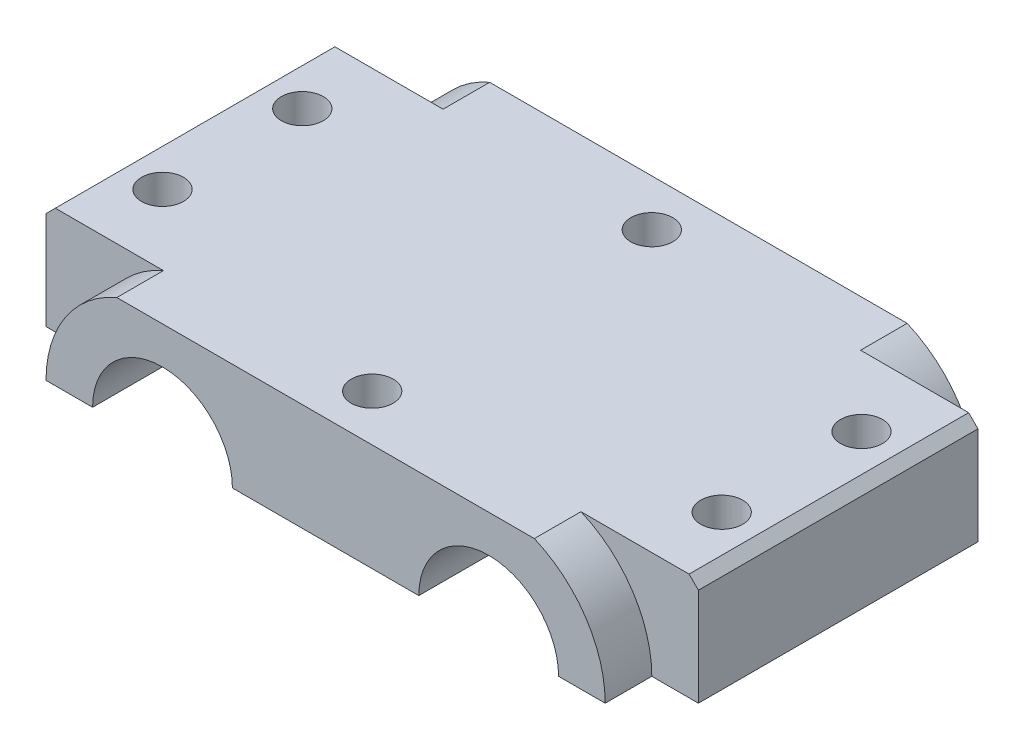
ISO-10303-21;
HEADER;
FILE_DESCRIPTION(('STEP AP214'),'2;1');
FILE_NAME('part.step','',(''),(''),'','','');
FILE_SCHEMA(('AUTOMOTIVE_DESIGN { 1 0 10303 214 1 1 1 1 }'));
ENDSEC;
DATA;
#1=APPLICATION_CONTEXT('core data for automotive mechanical design processes');
#2=APPLICATION_PROTOCOL_DEFINITION('international standard','automotive_design',2000,#1);
#3=PRODUCT_CONTEXT('',#1,'mechanical');
#4=PRODUCT('Part','Part','',(#3));
#5=PRODUCT_RELATED_PRODUCT_CATEGORY('part','',(#4));
#6=PRODUCT_DEFINITION_FORMATION('','',#4);
#7=PRODUCT_DEFINITION_CONTEXT('part definition',#1,'design');
#8=PRODUCT_DEFINITION('design','',#6,#7);
#9=PRODUCT_DEFINITION_SHAPE('','',#8);
#10=(LENGTH_UNIT() NAMED_UNIT(*) SI_UNIT(.MILLI.,.METRE.));
#11=(NAMED_UNIT(*) PLANE_ANGLE_UNIT() SI_UNIT($,.RADIAN.));
#12=(NAMED_UNIT(*) SI_UNIT($,.STERADIAN.) SOLID_ANGLE_UNIT());
#13=UNCERTAINTY_MEASURE_WITH_UNIT(LENGTH_MEASURE(1.E-05),#10,'distance_accuracy_value','');
#14=(GEOMETRIC_REPRESENTATION_CONTEXT(3) GLOBAL_UNCERTAINTY_ASSIGNED_CONTEXT((#13)) GLOBAL_UNIT_ASSIGNED_CONTEXT((#10,
#11,#12)) REPRESENTATION_CONTEXT('',''));
#15=CARTESIAN_POINT('',(0.,0.,0.));
#16=DIRECTION('',(0.,0.,1.));
#17=DIRECTION('',(1.,0.,0.));
#18=AXIS2_PLACEMENT_3D('',#15,#16,#17);
#19=CARTESIAN_POINT('',(-35.,11.5,-15.));
#20=DIRECTION('',(0.,0.,1.));
#21=DIRECTION('',(1.,0.,0.));
#22=AXIS2_PLACEMENT_3D('',#19,#20,#21);
#23=PLANE('',#22);
#24=DIRECTION('',(-1.,0.,0.));
#25=VECTOR('',#24,1.);
#26=CARTESIAN_POINT('',(-35.,11.5,-15.));
#27=LINE('',#26,#25);
#28=CARTESIAN_POINT('',(34.,11.5,-15.));
#29=VERTEX_POINT('',#28);
#30=CARTESIAN_POINT('',(22.3989794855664,11.5,-15.));
#31=VERTEX_POINT('',#30);
#32=EDGE_CURVE('E330',#29,#31,#27,.T.);
#33=ORIENTED_EDGE('',*,*,#32,.F.);
#34=DIRECTION('',(-0.707106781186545,0.70710678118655,0.));
#35=VECTOR('',#34,1.);
#36=CARTESIAN_POINT('',(34.,11.5,-15.));
#37=LINE('',#36,#35);
#38=CARTESIAN_POINT('',(35.,10.5,-15.));
#39=VERTEX_POINT('',#38);
#40=EDGE_CURVE('E65',#29,#39,#37,.F.);
#41=ORIENTED_EDGE('',*,*,#40,.T.);
#42=DIRECTION('',(0.,-1.,0.));
#43=VECTOR('',#42,1.);
#44=CARTESIAN_POINT('',(35.,11.5,-15.));
#45=LINE('',#44,#43);
#46=CARTESIAN_POINT('',(35.,0.,-15.));
#47=VERTEX_POINT('',#46);
#48=EDGE_CURVE('E363',#39,#47,#45,.T.);
#49=ORIENTED_EDGE('',*,*,#48,.T.);
#50=DIRECTION('',(-1.,0.,0.));
#51=VECTOR('',#50,1.);
#52=CARTESIAN_POINT('',(-35.,0.,-15.));
#53=LINE('',#52,#51);
#54=CARTESIAN_POINT('',(30.,0.,-15.));
#55=VERTEX_POINT('',#54);
#56=EDGE_CURVE('E343',#47,#55,#53,.T.);
#57=ORIENTED_EDGE('',*,*,#56,.T.);
#58=CARTESIAN_POINT('',(17.5,0.,-15.));
#59=DIRECTION('',(0.,0.,1.));
#60=DIRECTION('',(1.,0.,0.));
#61=AXIS2_PLACEMENT_3D('',#58,#59,#60);
#62=CIRCLE('',#61,12.5);
#63=EDGE_CURVE('E192',#55,#31,#62,.T.);
#64=ORIENTED_EDGE('',*,*,#63,.T.);
#65=EDGE_LOOP('',(#33,#41,#49,#57,#64));
#66=FACE_BOUND('',#65,.T.);
#67=ADVANCED_FACE('F41',(#66),#23,.F.);
#68=CARTESIAN_POINT('',(0.,0.,0.));
#69=DIRECTION('',(0.,-1.,0.));
#70=DIRECTION('',(0.,0.,-1.));
#71=AXIS2_PLACEMENT_3D('',#68,#69,#70);
#72=PLANE('',#71);
#73=CARTESIAN_POINT('',(0.,0.,-15.));
#74=DIRECTION('',(0.,1.,0.));
#75=DIRECTION('',(0.,0.,1.));
#76=AXIS2_PLACEMENT_3D('',#73,#74,#75);
#77=CIRCLE('',#76,2.25);
#78=CARTESIAN_POINT('',(0.,0.,-12.75));
#79=VERTEX_POINT('',#78);
#80=EDGE_CURVE('E228',#79,#79,#77,.T.);
#81=ORIENTED_EDGE('',*,*,#80,.T.);
#82=EDGE_LOOP('',(#81));
#83=FACE_BOUND('',#82,.T.);
#84=CARTESIAN_POINT('',(0.,0.,15.));
#85=DIRECTION('',(0.,1.,0.));
#86=DIRECTION('',(0.,0.,1.));
#87=AXIS2_PLACEMENT_3D('',#84,#85,#86);
#88=CIRCLE('',#87,2.25);
#89=CARTESIAN_POINT('',(0.,0.,17.25));
#90=VERTEX_POINT('',#89);
#91=EDGE_CURVE('E574',#90,#90,#88,.T.);
#92=ORIENTED_EDGE('',*,*,#91,.T.);
#93=EDGE_LOOP('',(#92));
#94=FACE_BOUND('',#93,.T.);
#95=DIRECTION('',(0.,0.,-1.));
#96=VECTOR('',#95,1.);
#97=CARTESIAN_POINT('',(-10.,0.,20.));
#98=LINE('',#97,#96);
#99=CARTESIAN_POINT('',(-10.,0.,20.));
#100=VERTEX_POINT('',#99);
#101=CARTESIAN_POINT('',(-10.,0.,-20.));
#102=VERTEX_POINT('',#101);
#103=EDGE_CURVE('E294',#100,#102,#98,.T.);
#104=ORIENTED_EDGE('',*,*,#103,.T.);
#105=DIRECTION('',(1.,0.,0.));
#106=VECTOR('',#105,1.);
#107=CARTESIAN_POINT('',(-10.,0.,-20.));
#108=LINE('',#107,#106);
#109=CARTESIAN_POINT('',(9.99999999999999,0.,-20.));
#110=VERTEX_POINT('',#109);
#111=EDGE_CURVE('E190',#102,#110,#108,.T.);
#112=ORIENTED_EDGE('',*,*,#111,.T.);
#113=DIRECTION('',(0.,0.,-1.));
#114=VECTOR('',#113,1.);
#115=CARTESIAN_POINT('',(9.99999999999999,0.,20.));
#116=LINE('',#115,#114);
#117=CARTESIAN_POINT('',(9.99999999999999,0.,20.));
#118=VERTEX_POINT('',#117);
#119=EDGE_CURVE('E291',#118,#110,#116,.T.);
#120=ORIENTED_EDGE('',*,*,#119,.F.);
#121=DIRECTION('',(1.,0.,0.));
#122=VECTOR('',#121,1.);
#123=CARTESIAN_POINT('',(-10.,0.,20.));
#124=LINE('',#123,#122);
#125=EDGE_CURVE('E246',#100,#118,#124,.T.);
#126=ORIENTED_EDGE('',*,*,#125,.F.);
#127=EDGE_LOOP('',(#104,#112,#120,#126));
#128=FACE_BOUND('',#127,.T.);
#129=ADVANCED_FACE('F431',(#83,#94,#128),#72,.T.);
#130=DIRECTION('',(0.,0.,-1.));
#131=VECTOR('',#130,1.);
#132=CARTESIAN_POINT('',(25.,0.,20.));
#133=LINE('',#132,#131);
#134=CARTESIAN_POINT('',(25.,0.,20.));
#135=VERTEX_POINT('',#134);
#136=CARTESIAN_POINT('',(25.,0.,-20.));
#137=VERTEX_POINT('',#136);
#138=EDGE_CURVE('E288',#135,#137,#133,.T.);
#139=ORIENTED_EDGE('',*,*,#138,.T.);
#140=DIRECTION('',(1.,0.,0.));
#141=VECTOR('',#140,1.);
#142=CARTESIAN_POINT('',(25.,0.,-20.));
#143=LINE('',#142,#141);
#144=CARTESIAN_POINT('',(30.,0.,-20.));
#145=VERTEX_POINT('',#144);
#146=EDGE_CURVE('E213',#137,#145,#143,.T.);
#147=ORIENTED_EDGE('',*,*,#146,.T.);
#148=DIRECTION('',(0.,0.,1.));
#149=VECTOR('',#148,1.);
#150=CARTESIAN_POINT('',(30.,0.,-20.));
#151=LINE('',#150,#149);
#152=EDGE_CURVE('E223',#145,#55,#151,.T.);
#153=ORIENTED_EDGE('',*,*,#152,.T.);
#154=ORIENTED_EDGE('',*,*,#56,.F.);
#155=DIRECTION('',(0.,0.,-1.));
#156=VECTOR('',#155,1.);
#157=CARTESIAN_POINT('',(35.,0.,15.));
#158=LINE('',#157,#156);
#159=CARTESIAN_POINT('',(35.,0.,15.));
#160=VERTEX_POINT('',#159);
#161=EDGE_CURVE('E326',#160,#47,#158,.T.);
#162=ORIENTED_EDGE('',*,*,#161,.F.);
#163=DIRECTION('',(1.,0.,0.));
#164=VECTOR('',#163,1.);
#165=CARTESIAN_POINT('',(-35.,0.,15.));
#166=LINE('',#165,#164);
#167=CARTESIAN_POINT('',(30.,0.,15.));
#168=VERTEX_POINT('',#167);
#169=EDGE_CURVE('E351',#168,#160,#166,.T.);
#170=ORIENTED_EDGE('',*,*,#169,.F.);
#171=DIRECTION('',(0.,0.,-1.));
#172=VECTOR('',#171,1.);
#173=CARTESIAN_POINT('',(30.,0.,20.));
#174=LINE('',#173,#172);
#175=CARTESIAN_POINT('',(30.,0.,20.));
#176=VERTEX_POINT('',#175);
#177=EDGE_CURVE('E284',#176,#168,#174,.T.);
#178=ORIENTED_EDGE('',*,*,#177,.F.);
#179=DIRECTION('',(1.,0.,0.));
#180=VECTOR('',#179,1.);
#181=CARTESIAN_POINT('',(25.,0.,20.));
#182=LINE('',#181,#180);
#183=EDGE_CURVE('E253',#135,#176,#182,.T.);
#184=ORIENTED_EDGE('',*,*,#183,.F.);
#185=EDGE_LOOP('',(#139,#147,#153,#154,#162,#170,#178,#184));
#186=FACE_BOUND('',#185,.T.);
#187=CARTESIAN_POINT('',(30.,0.,7.5));
#188=DIRECTION('',(0.,1.,0.));
#189=DIRECTION('',(0.,0.,1.));
#190=AXIS2_PLACEMENT_3D('',#187,#188,#189);
#191=CIRCLE('',#190,2.25);
#192=CARTESIAN_POINT('',(30.,0.,9.75));
#193=VERTEX_POINT('',#192);
#194=EDGE_CURVE('E298',#193,#193,#191,.T.);
#195=ORIENTED_EDGE('',*,*,#194,.T.);
#196=EDGE_LOOP('',(#195));
#197=FACE_BOUND('',#196,.T.);
#198=CARTESIAN_POINT('',(30.,0.,-7.5));
#199=DIRECTION('',(0.,1.,0.));
#200=DIRECTION('',(0.,0.,1.));
#201=AXIS2_PLACEMENT_3D('',#198,#199,#200);
#202=CIRCLE('',#201,2.25);
#203=CARTESIAN_POINT('',(30.,0.,-5.25));
#204=VERTEX_POINT('',#203);
#205=EDGE_CURVE('E315',#204,#204,#202,.T.);
#206=ORIENTED_EDGE('',*,*,#205,.T.);
#207=EDGE_LOOP('',(#206));
#208=FACE_BOUND('',#207,.T.);
#209=ADVANCED_FACE('F421',(#186,#197,#208),#72,.T.);
#210=CARTESIAN_POINT('',(-35.,11.5,15.));
#211=DIRECTION('',(0.,0.,-1.));
#212=DIRECTION('',(-1.,0.,0.));
#213=AXIS2_PLACEMENT_3D('',#210,#211,#212);
#214=PLANE('',#213);
#215=DIRECTION('',(1.,0.,0.));
#216=VECTOR('',#215,1.);
#217=CARTESIAN_POINT('',(-35.,11.5,15.));
#218=LINE('',#217,#216);
#219=CARTESIAN_POINT('',(-34.,11.5,15.));
#220=VERTEX_POINT('',#219);
#221=CARTESIAN_POINT('',(-22.3989794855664,11.5,15.));
#222=VERTEX_POINT('',#221);
#223=EDGE_CURVE('E335',#220,#222,#218,.T.);
#224=ORIENTED_EDGE('',*,*,#223,.F.);
#225=DIRECTION('',(0.707106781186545,0.70710678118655,0.));
#226=VECTOR('',#225,1.);
#227=CARTESIAN_POINT('',(-34.,11.5,15.));
#228=LINE('',#227,#226);
#229=CARTESIAN_POINT('',(-35.,10.5,15.));
#230=VERTEX_POINT('',#229);
#231=EDGE_CURVE('E374',#220,#230,#228,.F.);
#232=ORIENTED_EDGE('',*,*,#231,.T.);
#233=DIRECTION('',(0.,-1.,0.));
#234=VECTOR('',#233,1.);
#235=CARTESIAN_POINT('',(-35.,11.5,15.));
#236=LINE('',#235,#234);
#237=CARTESIAN_POINT('',(-35.,0.,15.));
#238=VERTEX_POINT('',#237);
#239=EDGE_CURVE('E357',#230,#238,#236,.T.);
#240=ORIENTED_EDGE('',*,*,#239,.T.);
#241=CARTESIAN_POINT('',(-30.,0.,15.));
#242=VERTEX_POINT('',#241);
#243=EDGE_CURVE('E352',#238,#242,#166,.T.);
#244=ORIENTED_EDGE('',*,*,#243,.T.);
#245=CARTESIAN_POINT('',(-17.5,0.,15.));
#246=DIRECTION('',(0.,0.,1.));
#247=DIRECTION('',(1.,0.,0.));
#248=AXIS2_PLACEMENT_3D('',#245,#246,#247);
#249=CIRCLE('',#248,12.5);
#250=EDGE_CURVE('E247',#222,#242,#249,.T.);
#251=ORIENTED_EDGE('',*,*,#250,.F.);
#252=EDGE_LOOP('',(#224,#232,#240,#244,#251));
#253=FACE_BOUND('',#252,.T.);
#254=ADVANCED_FACE('F441',(#253),#214,.F.);
#255=DIRECTION('',(0.,-1.,0.));
#256=VECTOR('',#255,1.);
#257=CARTESIAN_POINT('',(35.,11.5,15.));
#258=LINE('',#257,#256);
#259=CARTESIAN_POINT('',(35.,10.5,15.));
#260=VERTEX_POINT('',#259);
#261=EDGE_CURVE('E338',#260,#160,#258,.T.);
#262=ORIENTED_EDGE('',*,*,#261,.F.);
#263=DIRECTION('',(0.707106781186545,-0.70710678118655,0.));
#264=VECTOR('',#263,1.);
#265=CARTESIAN_POINT('',(34.,11.5,15.));
#266=LINE('',#265,#264);
#267=CARTESIAN_POINT('',(34.,11.5,15.));
#268=VERTEX_POINT('',#267);
#269=EDGE_CURVE('E11',#260,#268,#266,.F.);
#270=ORIENTED_EDGE('',*,*,#269,.T.);
#271=CARTESIAN_POINT('',(22.3989794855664,11.5,15.));
#272=VERTEX_POINT('',#271);
#273=EDGE_CURVE('E333',#272,#268,#218,.T.);
#274=ORIENTED_EDGE('',*,*,#273,.F.);
#275=CARTESIAN_POINT('',(17.5,0.,15.));
#276=DIRECTION('',(0.,0.,1.));
#277=DIRECTION('',(1.,0.,0.));
#278=AXIS2_PLACEMENT_3D('',#275,#276,#277);
#279=CIRCLE('',#278,12.5);
#280=EDGE_CURVE('E243',#168,#272,#279,.T.);
#281=ORIENTED_EDGE('',*,*,#280,.F.);
#282=ORIENTED_EDGE('',*,*,#169,.T.);
#283=EDGE_LOOP('',(#262,#270,#274,#281,#282));
#284=FACE_BOUND('',#283,.T.);
#285=ADVANCED_FACE('F450',(#284),#214,.F.);
#286=CARTESIAN_POINT('',(35.,11.5,15.));
#287=DIRECTION('',(-1.,0.,0.));
#288=DIRECTION('',(0.,0.,1.));
#289=AXIS2_PLACEMENT_3D('',#286,#287,#288);
#290=PLANE('',#289);
#291=ORIENTED_EDGE('',*,*,#48,.F.);
#292=DIRECTION('',(0.,0.,1.));
#293=VECTOR('',#292,1.);
#294=CARTESIAN_POINT('',(35.,10.5,15.));
#295=LINE('',#294,#293);
#296=EDGE_CURVE('E51',#39,#260,#295,.T.);
#297=ORIENTED_EDGE('',*,*,#296,.T.);
#298=ORIENTED_EDGE('',*,*,#261,.T.);
#299=ORIENTED_EDGE('',*,*,#161,.T.);
#300=EDGE_LOOP('',(#291,#297,#298,#299));
#301=FACE_BOUND('',#300,.T.);
#302=ADVANCED_FACE('F451',(#301),#290,.F.);
#303=DIRECTION('',(0.,-1.,0.));
#304=VECTOR('',#303,1.);
#305=CARTESIAN_POINT('',(-35.,11.5,-15.));
#306=LINE('',#305,#304);
#307=CARTESIAN_POINT('',(-35.,10.5,-15.));
#308=VERTEX_POINT('',#307);
#309=CARTESIAN_POINT('',(-35.,0.,-15.));
#310=VERTEX_POINT('',#309);
#311=EDGE_CURVE('E360',#308,#310,#306,.T.);
#312=ORIENTED_EDGE('',*,*,#311,.F.);
#313=DIRECTION('',(-0.707106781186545,-0.70710678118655,0.));
#314=VECTOR('',#313,1.);
#315=CARTESIAN_POINT('',(-34.,11.5,-15.));
#316=LINE('',#315,#314);
#317=CARTESIAN_POINT('',(-34.,11.5,-15.));
#318=VERTEX_POINT('',#317);
#319=EDGE_CURVE('E380',#308,#318,#316,.F.);
#320=ORIENTED_EDGE('',*,*,#319,.T.);
#321=CARTESIAN_POINT('',(-22.3989794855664,11.5,-15.));
#322=VERTEX_POINT('',#321);
#323=EDGE_CURVE('E334',#322,#318,#27,.T.);
#324=ORIENTED_EDGE('',*,*,#323,.F.);
#325=CARTESIAN_POINT('',(-17.5,0.,-15.));
#326=DIRECTION('',(0.,0.,1.));
#327=DIRECTION('',(1.,0.,0.));
#328=AXIS2_PLACEMENT_3D('',#325,#326,#327);
#329=CIRCLE('',#328,12.5);
#330=CARTESIAN_POINT('',(-30.,0.,-15.));
#331=VERTEX_POINT('',#330);
#332=EDGE_CURVE('E224',#322,#331,#329,.T.);
#333=ORIENTED_EDGE('',*,*,#332,.T.);
#334=EDGE_CURVE('E342',#331,#310,#53,.T.);
#335=ORIENTED_EDGE('',*,*,#334,.T.);
#336=EDGE_LOOP('',(#312,#320,#324,#333,#335));
#337=FACE_BOUND('',#336,.T.);
#338=ADVANCED_FACE('F396',(#337),#23,.F.);
#339=CARTESIAN_POINT('',(-35.,11.5,15.));
#340=DIRECTION('',(1.,0.,0.));
#341=DIRECTION('',(0.,0.,-1.));
#342=AXIS2_PLACEMENT_3D('',#339,#340,#341);
#343=PLANE('',#342);
#344=ORIENTED_EDGE('',*,*,#239,.F.);
#345=DIRECTION('',(0.,0.,-1.));
#346=VECTOR('',#345,1.);
#347=CARTESIAN_POINT('',(-35.,10.5,15.));
#348=LINE('',#347,#346);
#349=EDGE_CURVE('E377',#230,#308,#348,.T.);
#350=ORIENTED_EDGE('',*,*,#349,.T.);
#351=ORIENTED_EDGE('',*,*,#311,.T.);
#352=DIRECTION('',(0.,0.,1.));
#353=VECTOR('',#352,1.);
#354=CARTESIAN_POINT('',(-35.,0.,15.));
#355=LINE('',#354,#353);
#356=EDGE_CURVE('E347',#310,#238,#355,.T.);
#357=ORIENTED_EDGE('',*,*,#356,.T.);
#358=EDGE_LOOP('',(#344,#350,#351,#357));
#359=FACE_BOUND('',#358,.T.);
#360=ADVANCED_FACE('F403',(#359),#343,.F.);
#361=CARTESIAN_POINT('',(0.,11.5,0.));
#362=DIRECTION('',(0.,-1.,0.));
#363=DIRECTION('',(0.,0.,-1.));
#364=AXIS2_PLACEMENT_3D('',#361,#362,#363);
#365=PLANE('',#364);
#366=CARTESIAN_POINT('',(0.,11.5,-15.));
#367=DIRECTION('',(0.,1.,0.));
#368=DIRECTION('',(0.,0.,1.));
#369=AXIS2_PLACEMENT_3D('',#366,#367,#368);
#370=CIRCLE('',#369,2.25);
#371=CARTESIAN_POINT('',(0.,11.5,-12.75));
#372=VERTEX_POINT('',#371);
#373=EDGE_CURVE('E572',#372,#372,#370,.T.);
#374=ORIENTED_EDGE('',*,*,#373,.F.);
#375=EDGE_LOOP('',(#374));
#376=FACE_BOUND('',#375,.T.);
#377=CARTESIAN_POINT('',(0.,11.5,15.));
#378=DIRECTION('',(0.,1.,0.));
#379=DIRECTION('',(0.,0.,1.));
#380=AXIS2_PLACEMENT_3D('',#377,#378,#379);
#381=CIRCLE('',#380,2.25);
#382=CARTESIAN_POINT('',(0.,11.5,17.25));
#383=VERTEX_POINT('',#382);
#384=EDGE_CURVE('E580',#383,#383,#381,.T.);
#385=ORIENTED_EDGE('',*,*,#384,.F.);
#386=EDGE_LOOP('',(#385));
#387=FACE_BOUND('',#386,.T.);
#388=CARTESIAN_POINT('',(-30.,11.5,7.5));
#389=DIRECTION('',(0.,1.,0.));
#390=DIRECTION('',(0.,0.,1.));
#391=AXIS2_PLACEMENT_3D('',#388,#389,#390);
#392=CIRCLE('',#391,2.25);
#393=CARTESIAN_POINT('',(-30.,11.5,9.75));
#394=VERTEX_POINT('',#393);
#395=EDGE_CURVE('E311',#394,#394,#392,.T.);
#396=ORIENTED_EDGE('',*,*,#395,.F.);
#397=EDGE_LOOP('',(#396));
#398=FACE_BOUND('',#397,.T.);
#399=CARTESIAN_POINT('',(30.,11.5,-7.5));
#400=DIRECTION('',(0.,1.,0.));
#401=DIRECTION('',(0.,0.,1.));
#402=AXIS2_PLACEMENT_3D('',#399,#400,#401);
#403=CIRCLE('',#402,2.25);
#404=CARTESIAN_POINT('',(30.,11.5,-5.25));
#405=VERTEX_POINT('',#404);
#406=EDGE_CURVE('E302',#405,#405,#403,.T.);
#407=ORIENTED_EDGE('',*,*,#406,.F.);
#408=EDGE_LOOP('',(#407));
#409=FACE_BOUND('',#408,.T.);
#410=CARTESIAN_POINT('',(30.,11.5,7.5));
#411=DIRECTION('',(0.,1.,0.));
#412=DIRECTION('',(0.,0.,1.));
#413=AXIS2_PLACEMENT_3D('',#410,#411,#412);
#414=CIRCLE('',#413,2.25);
#415=CARTESIAN_POINT('',(30.,11.5,9.75));
#416=VERTEX_POINT('',#415);
#417=EDGE_CURVE('E297',#416,#416,#414,.T.);
#418=ORIENTED_EDGE('',*,*,#417,.F.);
#419=EDGE_LOOP('',(#418));
#420=FACE_BOUND('',#419,.T.);
#421=CARTESIAN_POINT('',(-30.,11.5,-7.5));
#422=DIRECTION('',(0.,1.,0.));
#423=DIRECTION('',(0.,0.,1.));
#424=AXIS2_PLACEMENT_3D('',#421,#422,#423);
#425=CIRCLE('',#424,2.25);
#426=CARTESIAN_POINT('',(-30.,11.5,-5.25));
#427=VERTEX_POINT('',#426);
#428=EDGE_CURVE('E310',#427,#427,#425,.T.);
#429=ORIENTED_EDGE('',*,*,#428,.F.);
#430=EDGE_LOOP('',(#429));
#431=FACE_BOUND('',#430,.T.);
#432=ORIENTED_EDGE('',*,*,#323,.T.);
#433=DIRECTION('',(0.,0.,1.));
#434=VECTOR('',#433,1.);
#435=CARTESIAN_POINT('',(-34.,11.5,0.));
#436=LINE('',#435,#434);
#437=EDGE_CURVE('E370',#318,#220,#436,.T.);
#438=ORIENTED_EDGE('',*,*,#437,.T.);
#439=ORIENTED_EDGE('',*,*,#223,.T.);
#440=DIRECTION('',(0.,0.,-1.));
#441=VECTOR('',#440,1.);
#442=CARTESIAN_POINT('',(-22.3989794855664,11.5,20.));
#443=LINE('',#442,#441);
#444=CARTESIAN_POINT('',(-22.3989794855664,11.5,20.));
#445=VERTEX_POINT('',#444);
#446=EDGE_CURVE('E276',#445,#222,#443,.T.);
#447=ORIENTED_EDGE('',*,*,#446,.F.);
#448=DIRECTION('',(-1.,0.,0.));
#449=VECTOR('',#448,1.);
#450=CARTESIAN_POINT('',(-22.3989794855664,11.5,20.));
#451=LINE('',#450,#449);
#452=CARTESIAN_POINT('',(22.3989794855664,11.5,20.));
#453=VERTEX_POINT('',#452);
#454=EDGE_CURVE('E259',#453,#445,#451,.T.);
#455=ORIENTED_EDGE('',*,*,#454,.F.);
#456=DIRECTION('',(0.,0.,-1.));
#457=VECTOR('',#456,1.);
#458=CARTESIAN_POINT('',(22.3989794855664,11.5,20.));
#459=LINE('',#458,#457);
#460=EDGE_CURVE('E280',#453,#272,#459,.T.);
#461=ORIENTED_EDGE('',*,*,#460,.T.);
#462=ORIENTED_EDGE('',*,*,#273,.T.);
#463=DIRECTION('',(0.,0.,-1.));
#464=VECTOR('',#463,1.);
#465=CARTESIAN_POINT('',(34.,11.5,0.));
#466=LINE('',#465,#464);
#467=EDGE_CURVE('E366',#268,#29,#466,.T.);
#468=ORIENTED_EDGE('',*,*,#467,.T.);
#469=ORIENTED_EDGE('',*,*,#32,.T.);
#470=DIRECTION('',(0.,0.,1.));
#471=VECTOR('',#470,1.);
#472=CARTESIAN_POINT('',(22.3989794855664,11.5,-20.));
#473=LINE('',#472,#471);
#474=CARTESIAN_POINT('',(22.3989794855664,11.5,-20.));
#475=VERTEX_POINT('',#474);
#476=EDGE_CURVE('E234',#475,#31,#473,.T.);
#477=ORIENTED_EDGE('',*,*,#476,.F.);
#478=DIRECTION('',(-1.,0.,0.));
#479=VECTOR('',#478,1.);
#480=CARTESIAN_POINT('',(-22.3989794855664,11.5,-20.));
#481=LINE('',#480,#479);
#482=CARTESIAN_POINT('',(-22.3989794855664,11.5,-20.));
#483=VERTEX_POINT('',#482);
#484=EDGE_CURVE('E202',#475,#483,#481,.T.);
#485=ORIENTED_EDGE('',*,*,#484,.T.);
#486=DIRECTION('',(0.,0.,1.));
#487=VECTOR('',#486,1.);
#488=CARTESIAN_POINT('',(-22.3989794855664,11.5,-20.));
#489=LINE('',#488,#487);
#490=EDGE_CURVE('E238',#483,#322,#489,.T.);
#491=ORIENTED_EDGE('',*,*,#490,.T.);
#492=EDGE_LOOP('',(#432,#438,#439,#447,#455,#461,#462,#468,#469,#477,#485,#491));
#493=FACE_BOUND('',#492,.T.);
#494=ADVANCED_FACE('F409',(#376,#387,#398,#409,#420,#431,#493),#365,.F.);
#495=ORIENTED_EDGE('',*,*,#334,.F.);
#496=DIRECTION('',(0.,0.,1.));
#497=VECTOR('',#496,1.);
#498=CARTESIAN_POINT('',(-30.,0.,-20.));
#499=LINE('',#498,#497);
#500=CARTESIAN_POINT('',(-30.,0.,-20.));
#501=VERTEX_POINT('',#500);
#502=EDGE_CURVE('E197',#501,#331,#499,.T.);
#503=ORIENTED_EDGE('',*,*,#502,.F.);
#504=DIRECTION('',(1.,0.,0.));
#505=VECTOR('',#504,1.);
#506=CARTESIAN_POINT('',(-30.,0.,-20.));
#507=LINE('',#506,#505);
#508=CARTESIAN_POINT('',(-25.,0.,-20.));
#509=VERTEX_POINT('',#508);
#510=EDGE_CURVE('E186',#501,#509,#507,.T.);
#511=ORIENTED_EDGE('',*,*,#510,.T.);
#512=DIRECTION('',(0.,0.,-1.));
#513=VECTOR('',#512,1.);
#514=CARTESIAN_POINT('',(-25.,0.,20.));
#515=LINE('',#514,#513);
#516=CARTESIAN_POINT('',(-25.,0.,20.));
#517=VERTEX_POINT('',#516);
#518=EDGE_CURVE('E167',#517,#509,#515,.T.);
#519=ORIENTED_EDGE('',*,*,#518,.F.);
#520=DIRECTION('',(1.,0.,0.));
#521=VECTOR('',#520,1.);
#522=CARTESIAN_POINT('',(-30.,0.,20.));
#523=LINE('',#522,#521);
#524=CARTESIAN_POINT('',(-30.,0.,20.));
#525=VERTEX_POINT('',#524);
#526=EDGE_CURVE('E180',#525,#517,#523,.T.);
#527=ORIENTED_EDGE('',*,*,#526,.F.);
#528=DIRECTION('',(0.,0.,-1.));
#529=VECTOR('',#528,1.);
#530=CARTESIAN_POINT('',(-30.,0.,20.));
#531=LINE('',#530,#529);
#532=EDGE_CURVE('E179',#525,#242,#531,.T.);
#533=ORIENTED_EDGE('',*,*,#532,.T.);
#534=ORIENTED_EDGE('',*,*,#243,.F.);
#535=ORIENTED_EDGE('',*,*,#356,.F.);
#536=EDGE_LOOP('',(#495,#503,#511,#519,#527,#533,#534,#535));
#537=FACE_BOUND('',#536,.T.);
#538=CARTESIAN_POINT('',(-30.,0.,7.5));
#539=DIRECTION('',(0.,1.,0.));
#540=DIRECTION('',(0.,0.,1.));
#541=AXIS2_PLACEMENT_3D('',#538,#539,#540);
#542=CIRCLE('',#541,2.25);
#543=CARTESIAN_POINT('',(-30.,0.,9.75));
#544=VERTEX_POINT('',#543);
#545=EDGE_CURVE('E306',#544,#544,#542,.T.);
#546=ORIENTED_EDGE('',*,*,#545,.T.);
#547=EDGE_LOOP('',(#546));
#548=FACE_BOUND('',#547,.T.);
#549=CARTESIAN_POINT('',(-30.,0.,-7.5));
#550=DIRECTION('',(0.,1.,0.));
#551=DIRECTION('',(0.,0.,1.));
#552=AXIS2_PLACEMENT_3D('',#549,#550,#551);
#553=CIRCLE('',#552,2.25);
#554=CARTESIAN_POINT('',(-30.,0.,-5.25));
#555=VERTEX_POINT('',#554);
#556=EDGE_CURVE('E322',#555,#555,#553,.T.);
#557=ORIENTED_EDGE('',*,*,#556,.T.);
#558=EDGE_LOOP('',(#557));
#559=FACE_BOUND('',#558,.T.);
#560=ADVANCED_FACE('F195',(#537,#548,#559),#72,.T.);
#561=CARTESIAN_POINT('',(-30.,0.,-7.5));
#562=DIRECTION('',(0.,1.,0.));
#563=DIRECTION('',(0.,0.,1.));
#564=AXIS2_PLACEMENT_3D('',#561,#562,#563);
#565=CYLINDRICAL_SURFACE('',#564,2.25);
#566=ORIENTED_EDGE('',*,*,#556,.F.);
#567=EDGE_LOOP('',(#566));
#568=FACE_BOUND('',#567,.T.);
#569=ORIENTED_EDGE('',*,*,#428,.T.);
#570=EDGE_LOOP('',(#569));
#571=FACE_BOUND('',#570,.T.);
#572=ADVANCED_FACE('F507',(#568,#571),#565,.F.);
#573=CARTESIAN_POINT('',(30.,0.,7.5));
#574=DIRECTION('',(0.,1.,0.));
#575=DIRECTION('',(0.,0.,1.));
#576=AXIS2_PLACEMENT_3D('',#573,#574,#575);
#577=CYLINDRICAL_SURFACE('',#576,2.25);
#578=ORIENTED_EDGE('',*,*,#194,.F.);
#579=EDGE_LOOP('',(#578));
#580=FACE_BOUND('',#579,.T.);
#581=ORIENTED_EDGE('',*,*,#417,.T.);
#582=EDGE_LOOP('',(#581));
#583=FACE_BOUND('',#582,.T.);
#584=ADVANCED_FACE('F503',(#580,#583),#577,.F.);
#585=CARTESIAN_POINT('',(30.,0.,-7.5));
#586=DIRECTION('',(0.,1.,0.));
#587=DIRECTION('',(0.,0.,1.));
#588=AXIS2_PLACEMENT_3D('',#585,#586,#587);
#589=CYLINDRICAL_SURFACE('',#588,2.25);
#590=ORIENTED_EDGE('',*,*,#205,.F.);
#591=EDGE_LOOP('',(#590));
#592=FACE_BOUND('',#591,.T.);
#593=ORIENTED_EDGE('',*,*,#406,.T.);
#594=EDGE_LOOP('',(#593));
#595=FACE_BOUND('',#594,.T.);
#596=ADVANCED_FACE('F506',(#592,#595),#589,.F.);
#597=CARTESIAN_POINT('',(-30.,0.,7.5));
#598=DIRECTION('',(0.,1.,0.));
#599=DIRECTION('',(0.,0.,1.));
#600=AXIS2_PLACEMENT_3D('',#597,#598,#599);
#601=CYLINDRICAL_SURFACE('',#600,2.25);
#602=ORIENTED_EDGE('',*,*,#545,.F.);
#603=EDGE_LOOP('',(#602));
#604=FACE_BOUND('',#603,.T.);
#605=ORIENTED_EDGE('',*,*,#395,.T.);
#606=EDGE_LOOP('',(#605));
#607=FACE_BOUND('',#606,.T.);
#608=ADVANCED_FACE('F502',(#604,#607),#601,.F.);
#609=CARTESIAN_POINT('',(-17.5,0.,20.));
#610=DIRECTION('',(0.,0.,-1.));
#611=DIRECTION('',(-1.,0.,0.));
#612=AXIS2_PLACEMENT_3D('',#609,#610,#611);
#613=CYLINDRICAL_SURFACE('',#612,7.5);
#614=ORIENTED_EDGE('',*,*,#518,.T.);
#615=CARTESIAN_POINT('',(-17.5,0.,-20.));
#616=DIRECTION('',(0.,0.,-1.));
#617=DIRECTION('',(1.,0.,0.));
#618=AXIS2_PLACEMENT_3D('',#615,#616,#617);
#619=CIRCLE('',#618,7.5);
#620=EDGE_CURVE('E171',#509,#102,#619,.T.);
#621=ORIENTED_EDGE('',*,*,#620,.T.);
#622=ORIENTED_EDGE('',*,*,#103,.F.);
#623=CARTESIAN_POINT('',(-17.5,0.,20.));
#624=DIRECTION('',(0.,0.,-1.));
#625=DIRECTION('',(1.,0.,0.));
#626=AXIS2_PLACEMENT_3D('',#623,#624,#625);
#627=CIRCLE('',#626,7.5);
#628=EDGE_CURVE('E174',#517,#100,#627,.T.);
#629=ORIENTED_EDGE('',*,*,#628,.F.);
#630=EDGE_LOOP('',(#614,#621,#622,#629));
#631=FACE_BOUND('',#630,.T.);
#632=ADVANCED_FACE('F169',(#631),#613,.F.);
#633=CARTESIAN_POINT('',(17.5,0.,20.));
#634=DIRECTION('',(0.,0.,-1.));
#635=DIRECTION('',(-1.,0.,0.));
#636=AXIS2_PLACEMENT_3D('',#633,#634,#635);
#637=CYLINDRICAL_SURFACE('',#636,7.50000000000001);
#638=ORIENTED_EDGE('',*,*,#119,.T.);
#639=CARTESIAN_POINT('',(17.5,0.,-20.));
#640=DIRECTION('',(0.,0.,-1.));
#641=DIRECTION('',(1.,0.,0.));
#642=AXIS2_PLACEMENT_3D('',#639,#640,#641);
#643=CIRCLE('',#642,7.50000000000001);
#644=EDGE_CURVE('E217',#110,#137,#643,.T.);
#645=ORIENTED_EDGE('',*,*,#644,.T.);
#646=ORIENTED_EDGE('',*,*,#138,.F.);
#647=CARTESIAN_POINT('',(17.5,0.,20.));
#648=DIRECTION('',(0.,0.,-1.));
#649=DIRECTION('',(1.,0.,0.));
#650=AXIS2_PLACEMENT_3D('',#647,#648,#649);
#651=CIRCLE('',#650,7.50000000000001);
#652=EDGE_CURVE('E250',#118,#135,#651,.T.);
#653=ORIENTED_EDGE('',*,*,#652,.F.);
#654=EDGE_LOOP('',(#638,#645,#646,#653));
#655=FACE_BOUND('',#654,.T.);
#656=ADVANCED_FACE('F427',(#655),#637,.F.);
#657=CARTESIAN_POINT('',(17.5,0.,20.));
#658=DIRECTION('',(0.,0.,-1.));
#659=DIRECTION('',(-1.,0.,0.));
#660=AXIS2_PLACEMENT_3D('',#657,#658,#659);
#661=CYLINDRICAL_SURFACE('',#660,12.5);
#662=ORIENTED_EDGE('',*,*,#280,.T.);
#663=ORIENTED_EDGE('',*,*,#460,.F.);
#664=CARTESIAN_POINT('',(17.5,0.,20.));
#665=DIRECTION('',(0.,0.,1.));
#666=DIRECTION('',(1.,0.,0.));
#667=AXIS2_PLACEMENT_3D('',#664,#665,#666);
#668=CIRCLE('',#667,12.5);
#669=EDGE_CURVE('E256',#176,#453,#668,.T.);
#670=ORIENTED_EDGE('',*,*,#669,.F.);
#671=ORIENTED_EDGE('',*,*,#177,.T.);
#672=EDGE_LOOP('',(#662,#663,#670,#671));
#673=FACE_BOUND('',#672,.T.);
#674=ADVANCED_FACE('F447',(#673),#661,.T.);
#675=CARTESIAN_POINT('',(-17.5,0.,20.));
#676=DIRECTION('',(0.,0.,-1.));
#677=DIRECTION('',(-1.,0.,0.));
#678=AXIS2_PLACEMENT_3D('',#675,#676,#677);
#679=CYLINDRICAL_SURFACE('',#678,12.5);
#680=ORIENTED_EDGE('',*,*,#250,.T.);
#681=ORIENTED_EDGE('',*,*,#532,.F.);
#682=CARTESIAN_POINT('',(-17.5,0.,20.));
#683=DIRECTION('',(0.,0.,1.));
#684=DIRECTION('',(1.,0.,0.));
#685=AXIS2_PLACEMENT_3D('',#682,#683,#684);
#686=CIRCLE('',#685,12.5);
#687=EDGE_CURVE('E262',#445,#525,#686,.T.);
#688=ORIENTED_EDGE('',*,*,#687,.F.);
#689=ORIENTED_EDGE('',*,*,#446,.T.);
#690=EDGE_LOOP('',(#680,#681,#688,#689));
#691=FACE_BOUND('',#690,.T.);
#692=ADVANCED_FACE('F437',(#691),#679,.T.);
#693=CARTESIAN_POINT('',(-17.5,0.,20.));
#694=DIRECTION('',(0.,0.,1.));
#695=DIRECTION('',(1.,0.,0.));
#696=AXIS2_PLACEMENT_3D('',#693,#694,#695);
#697=PLANE('',#696);
#698=ORIENTED_EDGE('',*,*,#628,.T.);
#699=ORIENTED_EDGE('',*,*,#125,.T.);
#700=ORIENTED_EDGE('',*,*,#652,.T.);
#701=ORIENTED_EDGE('',*,*,#183,.T.);
#702=ORIENTED_EDGE('',*,*,#669,.T.);
#703=ORIENTED_EDGE('',*,*,#454,.T.);
#704=ORIENTED_EDGE('',*,*,#687,.T.);
#705=ORIENTED_EDGE('',*,*,#526,.T.);
#706=EDGE_LOOP('',(#698,#699,#700,#701,#702,#703,#704,#705));
#707=FACE_BOUND('',#706,.T.);
#708=ADVANCED_FACE('F433',(#707),#697,.T.);
#709=CARTESIAN_POINT('',(-17.5,0.,-20.));
#710=DIRECTION('',(0.,0.,1.));
#711=DIRECTION('',(1.,0.,0.));
#712=AXIS2_PLACEMENT_3D('',#709,#710,#711);
#713=CYLINDRICAL_SURFACE('',#712,12.5);
#714=ORIENTED_EDGE('',*,*,#332,.F.);
#715=ORIENTED_EDGE('',*,*,#490,.F.);
#716=CARTESIAN_POINT('',(-17.5,0.,-20.));
#717=DIRECTION('',(0.,0.,1.));
#718=DIRECTION('',(1.,0.,0.));
#719=AXIS2_PLACEMENT_3D('',#716,#717,#718);
#720=CIRCLE('',#719,12.5);
#721=EDGE_CURVE('E199',#483,#501,#720,.T.);
#722=ORIENTED_EDGE('',*,*,#721,.T.);
#723=ORIENTED_EDGE('',*,*,#502,.T.);
#724=EDGE_LOOP('',(#714,#715,#722,#723));
#725=FACE_BOUND('',#724,.T.);
#726=ADVANCED_FACE('F413',(#725),#713,.T.);
#727=CARTESIAN_POINT('',(17.5,0.,-20.));
#728=DIRECTION('',(0.,0.,1.));
#729=DIRECTION('',(1.,0.,0.));
#730=AXIS2_PLACEMENT_3D('',#727,#728,#729);
#731=CYLINDRICAL_SURFACE('',#730,12.5);
#732=ORIENTED_EDGE('',*,*,#63,.F.);
#733=ORIENTED_EDGE('',*,*,#152,.F.);
#734=CARTESIAN_POINT('',(17.5,0.,-20.));
#735=DIRECTION('',(0.,0.,1.));
#736=DIRECTION('',(1.,0.,0.));
#737=AXIS2_PLACEMENT_3D('',#734,#735,#736);
#738=CIRCLE('',#737,12.5);
#739=EDGE_CURVE('E209',#145,#475,#738,.T.);
#740=ORIENTED_EDGE('',*,*,#739,.T.);
#741=ORIENTED_EDGE('',*,*,#476,.T.);
#742=EDGE_LOOP('',(#732,#733,#740,#741));
#743=FACE_BOUND('',#742,.T.);
#744=ADVANCED_FACE('F418',(#743),#731,.T.);
#745=CARTESIAN_POINT('',(-17.5,0.,-20.));
#746=DIRECTION('',(0.,0.,-1.));
#747=DIRECTION('',(1.,0.,0.));
#748=AXIS2_PLACEMENT_3D('',#745,#746,#747);
#749=PLANE('',#748);
#750=ORIENTED_EDGE('',*,*,#620,.F.);
#751=ORIENTED_EDGE('',*,*,#510,.F.);
#752=ORIENTED_EDGE('',*,*,#721,.F.);
#753=ORIENTED_EDGE('',*,*,#484,.F.);
#754=ORIENTED_EDGE('',*,*,#739,.F.);
#755=ORIENTED_EDGE('',*,*,#146,.F.);
#756=ORIENTED_EDGE('',*,*,#644,.F.);
#757=ORIENTED_EDGE('',*,*,#111,.F.);
#758=EDGE_LOOP('',(#750,#751,#752,#753,#754,#755,#756,#757));
#759=FACE_BOUND('',#758,.T.);
#760=ADVANCED_FACE('F184',(#759),#749,.T.);
#761=CARTESIAN_POINT('',(-34.,11.5,0.));
#762=DIRECTION('',(0.70710678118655,-0.707106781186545,0.));
#763=DIRECTION('',(0.,0.,1.));
#764=AXIS2_PLACEMENT_3D('',#761,#762,#763);
#765=PLANE('',#764);
#766=ORIENTED_EDGE('',*,*,#319,.F.);
#767=ORIENTED_EDGE('',*,*,#349,.F.);
#768=ORIENTED_EDGE('',*,*,#231,.F.);
#769=ORIENTED_EDGE('',*,*,#437,.F.);
#770=EDGE_LOOP('',(#766,#767,#768,#769));
#771=FACE_BOUND('',#770,.T.);
#772=ADVANCED_FACE('F406',(#771),#765,.F.);
#773=CARTESIAN_POINT('',(34.,11.5,0.));
#774=DIRECTION('',(-0.70710678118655,-0.707106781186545,0.));
#775=DIRECTION('',(0.,0.,-1.));
#776=AXIS2_PLACEMENT_3D('',#773,#774,#775);
#777=PLANE('',#776);
#778=ORIENTED_EDGE('',*,*,#269,.F.);
#779=ORIENTED_EDGE('',*,*,#296,.F.);
#780=ORIENTED_EDGE('',*,*,#40,.F.);
#781=ORIENTED_EDGE('',*,*,#467,.F.);
#782=EDGE_LOOP('',(#778,#779,#780,#781));
#783=FACE_BOUND('',#782,.T.);
#784=ADVANCED_FACE('F44',(#783),#777,.F.);
#785=CARTESIAN_POINT('',(0.,0.,15.));
#786=DIRECTION('',(0.,1.,0.));
#787=DIRECTION('',(0.,0.,1.));
#788=AXIS2_PLACEMENT_3D('',#785,#786,#787);
#789=CYLINDRICAL_SURFACE('',#788,2.25);
#790=ORIENTED_EDGE('',*,*,#91,.F.);
#791=EDGE_LOOP('',(#790));
#792=FACE_BOUND('',#791,.T.);
#793=ORIENTED_EDGE('',*,*,#384,.T.);
#794=EDGE_LOOP('',(#793));
#795=FACE_BOUND('',#794,.T.);
#796=ADVANCED_FACE('F481',(#792,#795),#789,.F.);
#797=CARTESIAN_POINT('',(0.,0.,-15.));
#798=DIRECTION('',(0.,1.,0.));
#799=DIRECTION('',(0.,0.,1.));
#800=AXIS2_PLACEMENT_3D('',#797,#798,#799);
#801=CYLINDRICAL_SURFACE('',#800,2.25);
#802=ORIENTED_EDGE('',*,*,#80,.F.);
#803=EDGE_LOOP('',(#802));
#804=FACE_BOUND('',#803,.T.);
#805=ORIENTED_EDGE('',*,*,#373,.T.);
#806=EDGE_LOOP('',(#805));
#807=FACE_BOUND('',#806,.T.);
#808=ADVANCED_FACE('F555',(#804,#807),#801,.F.);
#809=CLOSED_SHELL('',(#67,#129,#209,#254,#285,#302,#338,#360,#494,#560,#572,#584,#596,#608,#632,
#656,#674,#692,#708,#726,#744,#760,#772,#784,#796,#808));
#810=MANIFOLD_SOLID_BREP('B2',#809);
#811=ADVANCED_BREP_SHAPE_REPRESENTATION('',(#18,#810),#14);
#812=SHAPE_DEFINITION_REPRESENTATION(#9,#811);
ENDSEC;
END-ISO-10303-21;
